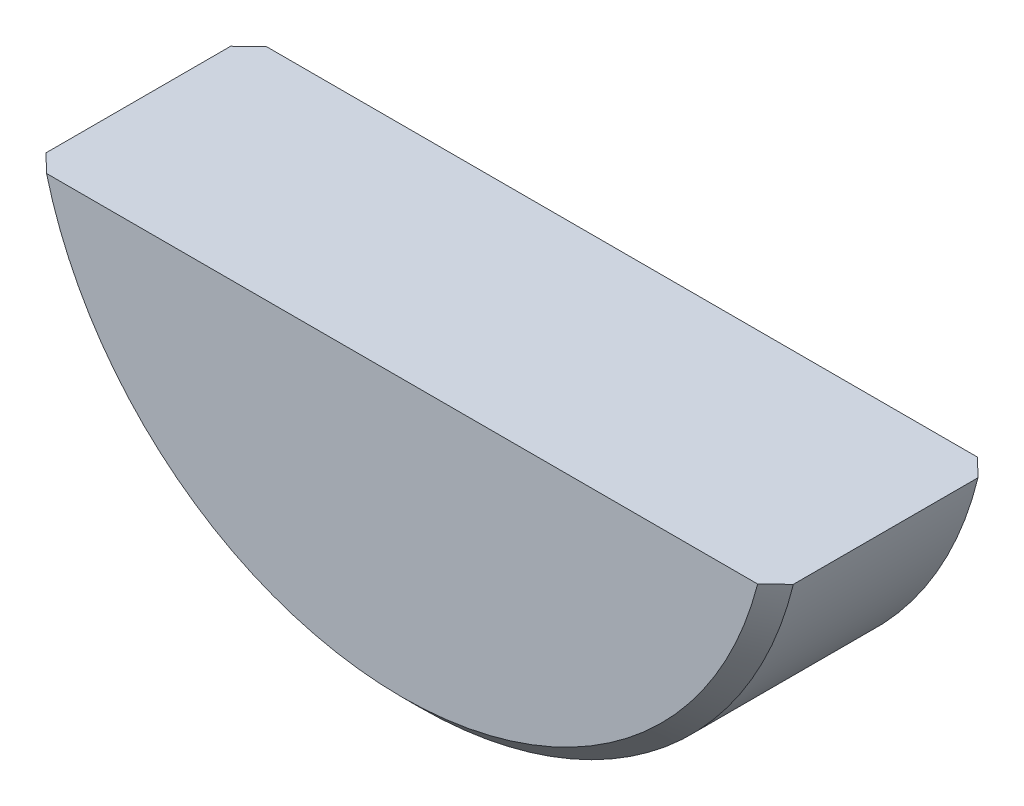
ISO-10303-21;
HEADER;
FILE_DESCRIPTION(('STEP AP214'),'2;1');
FILE_NAME('part.step','',(''),(''),'','','');
FILE_SCHEMA(('AUTOMOTIVE_DESIGN { 1 0 10303 214 1 1 1 1 }'));
ENDSEC;
DATA;
#1=APPLICATION_CONTEXT('core data for automotive mechanical design processes');
#2=APPLICATION_PROTOCOL_DEFINITION('international standard','automotive_design',2000,#1);
#3=PRODUCT_CONTEXT('',#1,'mechanical');
#4=PRODUCT('Part','Part','',(#3));
#5=PRODUCT_RELATED_PRODUCT_CATEGORY('part','',(#4));
#6=PRODUCT_DEFINITION_FORMATION('','',#4);
#7=PRODUCT_DEFINITION_CONTEXT('part definition',#1,'design');
#8=PRODUCT_DEFINITION('design','',#6,#7);
#9=PRODUCT_DEFINITION_SHAPE('','',#8);
#10=(LENGTH_UNIT() NAMED_UNIT(*) SI_UNIT(.MILLI.,.METRE.));
#11=(NAMED_UNIT(*) PLANE_ANGLE_UNIT() SI_UNIT($,.RADIAN.));
#12=(NAMED_UNIT(*) SI_UNIT($,.STERADIAN.) SOLID_ANGLE_UNIT());
#13=UNCERTAINTY_MEASURE_WITH_UNIT(LENGTH_MEASURE(1.E-05),#10,'distance_accuracy_value','');
#14=(GEOMETRIC_REPRESENTATION_CONTEXT(3) GLOBAL_UNCERTAINTY_ASSIGNED_CONTEXT((#13)) GLOBAL_UNIT_ASSIGNED_CONTEXT((#10,
#11,#12)) REPRESENTATION_CONTEXT('',''));
#15=CARTESIAN_POINT('',(0.,0.,0.));
#16=DIRECTION('',(0.,0.,1.));
#17=DIRECTION('',(1.,0.,0.));
#18=AXIS2_PLACEMENT_3D('',#15,#16,#17);
#19=CARTESIAN_POINT('',(0.,0.,1.));
#20=DIRECTION('',(0.,0.,-1.));
#21=DIRECTION('',(-1.,0.,0.));
#22=AXIS2_PLACEMENT_3D('',#19,#20,#21);
#23=CYLINDRICAL_SURFACE('',#22,3.5);
#24=DIRECTION('',(0.,0.,-1.));
#25=VECTOR('',#24,1.);
#26=CARTESIAN_POINT('',(3.4,-0.830662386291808,1.));
#27=LINE('',#26,#25);
#28=CARTESIAN_POINT('',(3.4,-0.830662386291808,0.840000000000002));
#29=VERTEX_POINT('',#28);
#30=CARTESIAN_POINT('',(3.4,-0.830662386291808,-0.839999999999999));
#31=VERTEX_POINT('',#30);
#32=EDGE_CURVE('E88',#29,#31,#27,.T.);
#33=ORIENTED_EDGE('',*,*,#32,.F.);
#34=CARTESIAN_POINT('',(0.,0.,0.840000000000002));
#35=DIRECTION('',(0.,0.,1.));
#36=DIRECTION('',(1.,0.,0.));
#37=AXIS2_PLACEMENT_3D('',#34,#35,#36);
#38=CIRCLE('',#37,3.5);
#39=CARTESIAN_POINT('',(-3.4,-0.830662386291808,0.840000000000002));
#40=VERTEX_POINT('',#39);
#41=EDGE_CURVE('E42',#29,#40,#38,.F.);
#42=ORIENTED_EDGE('',*,*,#41,.T.);
#43=DIRECTION('',(0.,0.,-1.));
#44=VECTOR('',#43,1.);
#45=CARTESIAN_POINT('',(-3.4,-0.830662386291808,1.));
#46=LINE('',#45,#44);
#47=CARTESIAN_POINT('',(-3.4,-0.830662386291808,-0.839999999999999));
#48=VERTEX_POINT('',#47);
#49=EDGE_CURVE('E92',#40,#48,#46,.T.);
#50=ORIENTED_EDGE('',*,*,#49,.T.);
#51=CARTESIAN_POINT('',(0.,0.,-0.839999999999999));
#52=DIRECTION('',(0.,0.,1.));
#53=DIRECTION('',(1.,0.,0.));
#54=AXIS2_PLACEMENT_3D('',#51,#52,#53);
#55=CIRCLE('',#54,3.5);
#56=EDGE_CURVE('E80',#48,#31,#55,.T.);
#57=ORIENTED_EDGE('',*,*,#56,.T.);
#58=EDGE_LOOP('',(#33,#42,#50,#57));
#59=FACE_BOUND('',#58,.T.);
#60=ADVANCED_FACE('F33',(#59),#23,.T.);
#61=CARTESIAN_POINT('',(-3.4,-0.830662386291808,1.));
#62=DIRECTION('',(0.,-1.,0.));
#63=DIRECTION('',(0.,0.,-1.));
#64=AXIS2_PLACEMENT_3D('',#61,#62,#63);
#65=PLANE('',#64);
#66=DIRECTION('',(-1.,0.,0.));
#67=VECTOR('',#66,1.);
#68=CARTESIAN_POINT('',(-3.4,-0.830662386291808,1.));
#69=LINE('',#68,#67);
#70=CARTESIAN_POINT('',(3.23505795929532,-0.830662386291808,1.));
#71=VERTEX_POINT('',#70);
#72=CARTESIAN_POINT('',(-3.23505795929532,-0.830662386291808,1.));
#73=VERTEX_POINT('',#72);
#74=EDGE_CURVE('E86',#71,#73,#69,.T.);
#75=ORIENTED_EDGE('',*,*,#74,.F.);
#76=CARTESIAN_POINT('',(3.23505795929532,-0.830662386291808,1.));
#77=CARTESIAN_POINT('',(3.26256785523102,-0.830662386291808,0.973353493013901));
#78=CARTESIAN_POINT('',(3.29006797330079,-0.830662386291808,0.946696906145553));
#79=CARTESIAN_POINT('',(3.34504865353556,-0.830662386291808,0.893363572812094));
#80=CARTESIAN_POINT('',(3.37252921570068,-0.830662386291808,0.866686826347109));
#81=CARTESIAN_POINT('',(3.4,-0.830662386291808,0.840000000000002));
#82=B_SPLINE_CURVE_WITH_KNOTS('',3,(#76,#77,#78,#79,#80,#81),.UNSPECIFIED.,.F.,.F.,(4,2,4),(0.,
0.114897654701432,0.229795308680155),.UNSPECIFIED.);
#83=EDGE_CURVE('E57',#71,#29,#82,.T.);
#84=ORIENTED_EDGE('',*,*,#83,.T.);
#85=ORIENTED_EDGE('',*,*,#32,.T.);
#86=CARTESIAN_POINT('',(3.4,-0.830662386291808,-0.839999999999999));
#87=CARTESIAN_POINT('',(3.37252921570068,-0.830662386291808,-0.866686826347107));
#88=CARTESIAN_POINT('',(3.34504865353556,-0.830662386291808,-0.893363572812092));
#89=CARTESIAN_POINT('',(3.29006797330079,-0.830662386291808,-0.946696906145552));
#90=CARTESIAN_POINT('',(3.26256785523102,-0.830662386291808,-0.973353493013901));
#91=CARTESIAN_POINT('',(3.23505795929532,-0.830662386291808,-1.));
#92=B_SPLINE_CURVE_WITH_KNOTS('',3,(#86,#87,#88,#89,#90,#91),.UNSPECIFIED.,.F.,.F.,(4,2,4),(0.,
0.114897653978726,0.229795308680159),.UNSPECIFIED.);
#93=CARTESIAN_POINT('',(3.23505795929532,-0.830662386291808,-1.));
#94=VERTEX_POINT('',#93);
#95=EDGE_CURVE('E49',#31,#94,#92,.T.);
#96=ORIENTED_EDGE('',*,*,#95,.T.);
#97=DIRECTION('',(-1.,0.,0.));
#98=VECTOR('',#97,1.);
#99=CARTESIAN_POINT('',(-3.4,-0.830662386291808,-1.));
#100=LINE('',#99,#98);
#101=CARTESIAN_POINT('',(-3.23505795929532,-0.830662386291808,-1.));
#102=VERTEX_POINT('',#101);
#103=EDGE_CURVE('E93',#94,#102,#100,.T.);
#104=ORIENTED_EDGE('',*,*,#103,.T.);
#105=CARTESIAN_POINT('',(-3.23505795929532,-0.830662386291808,-1.));
#106=CARTESIAN_POINT('',(-3.26256785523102,-0.830662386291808,-0.973353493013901));
#107=CARTESIAN_POINT('',(-3.29006797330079,-0.830662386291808,-0.946696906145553));
#108=CARTESIAN_POINT('',(-3.34504865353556,-0.830662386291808,-0.893363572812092));
#109=CARTESIAN_POINT('',(-3.37252921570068,-0.830662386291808,-0.866686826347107));
#110=CARTESIAN_POINT('',(-3.4,-0.830662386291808,-0.839999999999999));
#111=B_SPLINE_CURVE_WITH_KNOTS('',3,(#105,#106,#107,#108,#109,#110),.UNSPECIFIED.,.F.,.F.,(4,2,
4),(0.,0.114897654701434,0.22979530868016),.UNSPECIFIED.);
#112=EDGE_CURVE('E87',#102,#48,#111,.T.);
#113=ORIENTED_EDGE('',*,*,#112,.T.);
#114=ORIENTED_EDGE('',*,*,#49,.F.);
#115=CARTESIAN_POINT('',(-3.4,-0.830662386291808,0.840000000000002));
#116=CARTESIAN_POINT('',(-3.37252921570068,-0.830662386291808,0.866686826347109));
#117=CARTESIAN_POINT('',(-3.34504865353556,-0.830662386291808,0.893363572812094));
#118=CARTESIAN_POINT('',(-3.29006797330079,-0.830662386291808,0.946696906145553));
#119=CARTESIAN_POINT('',(-3.26256785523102,-0.830662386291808,0.973353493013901));
#120=CARTESIAN_POINT('',(-3.23505795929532,-0.830662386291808,1.));
#121=B_SPLINE_CURVE_WITH_KNOTS('',3,(#115,#116,#117,#118,#119,#120),.UNSPECIFIED.,.F.,.F.,(4,2,
4),(0.,0.114897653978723,0.229795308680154),.UNSPECIFIED.);
#122=EDGE_CURVE('E81',#40,#73,#121,.T.);
#123=ORIENTED_EDGE('',*,*,#122,.T.);
#124=EDGE_LOOP('',(#75,#84,#85,#96,#104,#113,#114,#123));
#125=FACE_BOUND('',#124,.T.);
#126=ADVANCED_FACE('F90',(#125),#65,.F.);
#127=CARTESIAN_POINT('',(0.,0.,1.));
#128=DIRECTION('',(0.,0.,1.));
#129=DIRECTION('',(1.,0.,0.));
#130=AXIS2_PLACEMENT_3D('',#127,#128,#129);
#131=PLANE('',#130);
#132=ORIENTED_EDGE('',*,*,#74,.T.);
#133=CARTESIAN_POINT('',(0.,0.,1.));
#134=DIRECTION('',(0.,0.,1.));
#135=DIRECTION('',(1.,0.,0.));
#136=AXIS2_PLACEMENT_3D('',#133,#134,#135);
#137=CIRCLE('',#136,3.34);
#138=EDGE_CURVE('E79',#73,#71,#137,.T.);
#139=ORIENTED_EDGE('',*,*,#138,.T.);
#140=EDGE_LOOP('',(#132,#139));
#141=FACE_BOUND('',#140,.T.);
#142=ADVANCED_FACE('F85',(#141),#131,.T.);
#143=CARTESIAN_POINT('',(0.,0.,-1.));
#144=DIRECTION('',(0.,0.,1.));
#145=DIRECTION('',(1.,0.,0.));
#146=AXIS2_PLACEMENT_3D('',#143,#144,#145);
#147=PLANE('',#146);
#148=ORIENTED_EDGE('',*,*,#103,.F.);
#149=CARTESIAN_POINT('',(0.,0.,-1.));
#150=DIRECTION('',(0.,0.,1.));
#151=DIRECTION('',(1.,0.,0.));
#152=AXIS2_PLACEMENT_3D('',#149,#150,#151);
#153=CIRCLE('',#152,3.34);
#154=EDGE_CURVE('E11',#94,#102,#153,.F.);
#155=ORIENTED_EDGE('',*,*,#154,.T.);
#156=EDGE_LOOP('',(#148,#155));
#157=FACE_BOUND('',#156,.T.);
#158=ADVANCED_FACE('F114',(#157),#147,.F.);
#159=CARTESIAN_POINT('',(0.,0.,1.));
#160=DIRECTION('',(0.,0.,-1.));
#161=DIRECTION('',(-1.,0.,0.));
#162=AXIS2_PLACEMENT_3D('',#159,#160,#161);
#163=CONICAL_SURFACE('',#162,3.34,0.785398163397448);
#164=ORIENTED_EDGE('',*,*,#122,.F.);
#165=ORIENTED_EDGE('',*,*,#41,.F.);
#166=ORIENTED_EDGE('',*,*,#83,.F.);
#167=ORIENTED_EDGE('',*,*,#138,.F.);
#168=EDGE_LOOP('',(#164,#165,#166,#167));
#169=FACE_BOUND('',#168,.T.);
#170=ADVANCED_FACE('F78',(#169),#163,.T.);
#171=CARTESIAN_POINT('',(0.,0.,-0.839999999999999));
#172=DIRECTION('',(0.,0.,1.));
#173=DIRECTION('',(1.,0.,0.));
#174=AXIS2_PLACEMENT_3D('',#171,#172,#173);
#175=CONICAL_SURFACE('',#174,3.5,0.785398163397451);
#176=ORIENTED_EDGE('',*,*,#112,.F.);
#177=ORIENTED_EDGE('',*,*,#154,.F.);
#178=ORIENTED_EDGE('',*,*,#95,.F.);
#179=ORIENTED_EDGE('',*,*,#56,.F.);
#180=EDGE_LOOP('',(#176,#177,#178,#179));
#181=FACE_BOUND('',#180,.T.);
#182=ADVANCED_FACE('F35',(#181),#175,.T.);
#183=CLOSED_SHELL('',(#60,#126,#142,#158,#170,#182));
#184=MANIFOLD_SOLID_BREP('B2',#183);
#185=ADVANCED_BREP_SHAPE_REPRESENTATION('',(#18,#184),#14);
#186=SHAPE_DEFINITION_REPRESENTATION(#9,#185);
ENDSEC;
END-ISO-10303-21;
